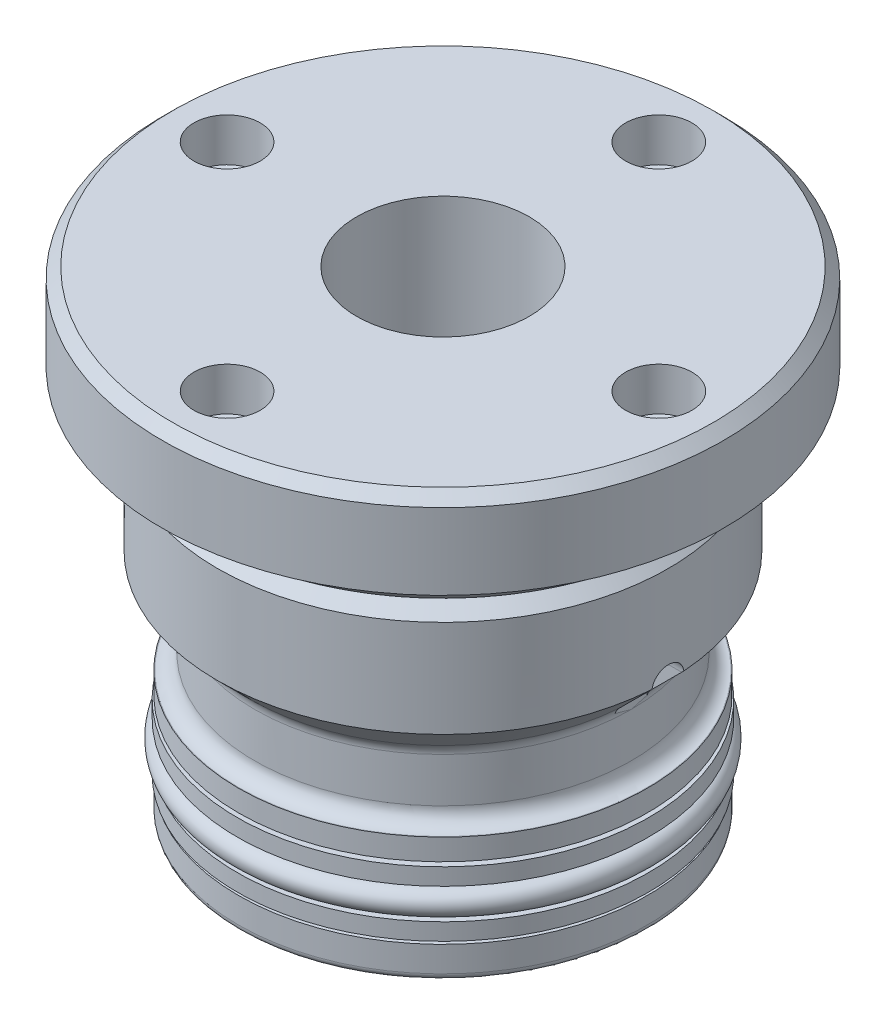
from build123d import *

# Parameters (mm, degrees)
FILLET1_R               = 1.143
FILLET2_R               = 0.381
FILLET3_R               = 0.508
CIRPATTERN1_COUNT       = 4
CHAMFER1_SIZE           = 0.762000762
FILLET4_R               = 0.381
SKETCH5_R               = 1.3081
SKETCH6_R               = 0.889
SKETCH6_W               = 1.3462
SKETCH6_H               = 1.2446
CUT_EXTRUDE1_DEPTH      = 46.514486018
CUT_EXTRUDE1_DEPTH_BACK = 46.514486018
SKETCH7_R               = 1.1811
CUT_EXTRUDE3_START      = 13.843
CUT_EXTRUDE3_DEPTH      = 27.686


with BuildPart() as part:
    # Sketch1 → Revolve1 (revolve)
    with BuildSketch(Plane.XY, mode=Mode.PRIVATE) as revolve1_sk:
        Polygon((-11.1125, 0), (-11.1125, 18.2372), (-6.35, 18.2372), (-6.35, 34.925), (-20.6375, 34.925), (-20.6375, 28.575), (-16.5862, 28.575), (-16.5862, 16.8529), (-13.843, 14.1097), (-13.843, 9.2202), (-15.0368, 9.2202), (-15.0368, 7.6454), (-13.7795, 7.6454), (-13.7795, 2.3876), (-15.0368, 2.3876), (-15.0368, 0), align=None)
    revolve(revolve1_sk.sketch.rotate(Axis((0, 0, 0), (0, 1, 0)), 270), axis=Axis((0, 0, 0), (0, 1, 0)))

    # Fillet1
    fillet1_edges = [part.edges().sort_by_distance(p)[0] for p in [
        (0, 9.2202, 13.843),
        (0, 14.1097, 13.843),
    ]]
    fillet(fillet1_edges, radius=FILLET1_R)

    # Fillet2
    fillet2_edges = [part.edges().sort_by_distance(p)[0] for p in [
        (0, 2.3876, 13.7795),
        (0, 7.6454, 13.7795),
    ]]
    fillet(fillet2_edges, radius=FILLET2_R)

    # Fillet3
    fillet3_edges = [part.edges().sort_by_distance(p)[0] for p in [
        (0, 0, 15.0368),
    ]]
    fillet(fillet3_edges, radius=FILLET3_R)

    # Sketch2 → Hole1 (revolve, cut)
    with BuildSketch(Plane(origin=(15.875, 34.925, 0), x_dir=(0, 0, 1), z_dir=(1, 0, 0))):
        Polygon((0, 0), (0, 4.640138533), (2.4384, 3.175), (2.4384, 0), align=None)
    hole1 = revolve(axis=Axis((15.875, 39.169199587, 0), (0, -1, 0)), mode=Mode.SUBTRACT)

    # CirPattern1: Hole1 ×4 about axis
    cirpattern1_axis = Axis((0, 0, 0), (0, 1, 0))
    for i in range(1, CIRPATTERN1_COUNT):
        add(hole1.rotate(cirpattern1_axis, i * 360 / CIRPATTERN1_COUNT), mode=Mode.SUBTRACT)

    # Chamfer1
    chamfer1_edges = [part.edges().sort_by_distance(p)[0] for p in [
        (0, 34.925, 20.6375),
    ]]
    chamfer(chamfer1_edges, length=CHAMFER1_SIZE)

    # Sketch4 → Cut-Revolve1 (revolve, cut)
    with BuildSketch(Plane.XY, mode=Mode.PRIVATE) as cut_revolve1_sk:
        Polygon((-16.5862, 28.575), (-16.5862, 23.9903), (-15.4559, 25.1206), (-15.4559, 28.575), align=None)
    revolve(cut_revolve1_sk.sketch.rotate(Axis((0, 0, 0), (0, 1, 0)), 270), axis=Axis((0, 0, 0), (0, 1, 0)), mode=Mode.SUBTRACT)

    # Fillet4
    fillet4_edges = [part.edges().sort_by_distance(p)[0] for p in [
        (0, 28.575, 15.4559),
        (0, 25.1206, 15.4559),
    ]]
    fillet(fillet4_edges, radius=FILLET4_R)

    # Sketch5 → Revolve2 (revolve)
    with BuildSketch(Plane.XY, mode=Mode.PRIVATE) as revolve2_sk:
        with Locations((-16.7259, 27.2288)):
            Circle(SKETCH5_R)
    revolve(revolve2_sk.sketch.rotate(Axis((0, 0, 0), (0, 1, 0)), 270), axis=Axis((0, 0, 0), (0, 1, 0)))

    # Sketch6 → Revolve3 (revolve)
    with BuildSketch(Plane.XY, mode=Mode.PRIVATE) as revolve3_sk:
        with Locations((-14.6177, 4.9276)):
            Circle(SKETCH6_R)
        with Locations((-14.4526, 6.7691)):
            Rectangle(SKETCH6_W, SKETCH6_H)
        with Locations((-14.4526, 3.2639)):
            Rectangle(SKETCH6_W, SKETCH6_H)
    revolve(revolve3_sk.sketch.rotate(Axis((0, 0, 0), (0, 1, 0)), 270), axis=Axis((0, 0, 0), (0, 1, 0)))

    # Sketch7 → Cut-Extrude1 (cut, two sides: drawn at the far end of the back side and taken through both)
    with BuildSketch(Plane(origin=(0, 0, 0), x_dir=(0, 0, -1), z_dir=(1, 0, 0)).offset(-CUT_EXTRUDE1_DEPTH_BACK)):
        with Locations((0, 16.6878)):
            Circle(SKETCH7_R)
    extrude(amount=CUT_EXTRUDE1_DEPTH + CUT_EXTRUDE1_DEPTH_BACK, mode=Mode.SUBTRACT)

    # Sketch8 → Cut-Extrude3 (cut)
    with BuildSketch(Plane(origin=(0, 0, 0), x_dir=(0, 0, -1), z_dir=(1, 0, 0)).offset(CUT_EXTRUDE3_START)):
        with BuildLine():
            Line((-1.1811, 16.6878), (-1.1811, 11.9253))
            ThreePointArc((-1.1811, 11.9253), (0, 10.7442), (1.1811, 11.9253))
            Line((1.1811, 11.9253), (1.1811, 16.6878))
            ThreePointArc((1.1811, 16.6878), (0, 17.8689), (-1.1811, 16.6878))
        make_face()
    cut_extrude3 = extrude(amount=CUT_EXTRUDE3_DEPTH, mode=Mode.SUBTRACT)

    # Mirror1: Cut-Extrude3 across plane
    add(cut_extrude3.mirror(Plane(origin=(0, 0, 0), x_dir=(0, 0, 1), z_dir=(1, 0, 0))), mode=Mode.SUBTRACT)


solid = part.part
